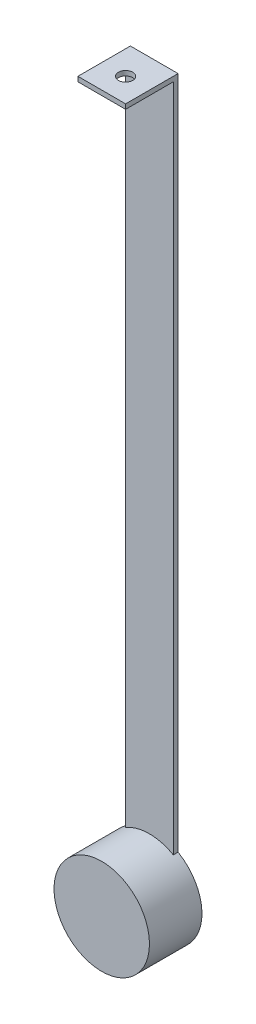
from build123d import *

# Parameters (mm, degrees)
SKETCH1_R          = 10
EXTRUDE1_DEPTH     = 11
EXTRUDE2_DEPTH     = 1
SKETCH3_W          = 10
SKETCH3_H          = 1
EXTRUDE3_DEPTH     = 10
SKETCH4_R          = 1.5
CUT_EXTRUDE1_DEPTH = 1


with BuildPart() as part:
    # Sketch1 → Extrude1 (new body)
    with BuildSketch(Plane.XY):
        Circle(SKETCH1_R)
    extrude(amount=EXTRUDE1_DEPTH)

    # Sketch2 → Extrude2 (add)
    with BuildSketch(Plane.XY):
        with BuildLine():
            Line((5, 8.660254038), (5, 150))
            Line((5, 150), (-5, 150))
            Line((-5, 150), (-5, 8.660254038))
            ThreePointArc((-5, 8.660254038), (0, 10), (5, 8.660254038))
        make_face()
    extrude(amount=EXTRUDE2_DEPTH)

    # Sketch3 → Extrude3 (add)
    with BuildSketch(Plane.XY.offset(1)):
        with Locations((0, 149.5)):
            Rectangle(SKETCH3_W, SKETCH3_H)
    extrude(amount=EXTRUDE3_DEPTH)

    # Sketch4 → Cut-Extrude1 (cut)
    with BuildSketch(Plane(origin=(0, 150, 0), x_dir=(-1, 0, 0), z_dir=(0, 1, 0))):
        with Locations(Location((0, 6, 0), (0, 0, 90))):
            Circle(SKETCH4_R)
    extrude(amount=-CUT_EXTRUDE1_DEPTH, mode=Mode.SUBTRACT)


solid = part.part
